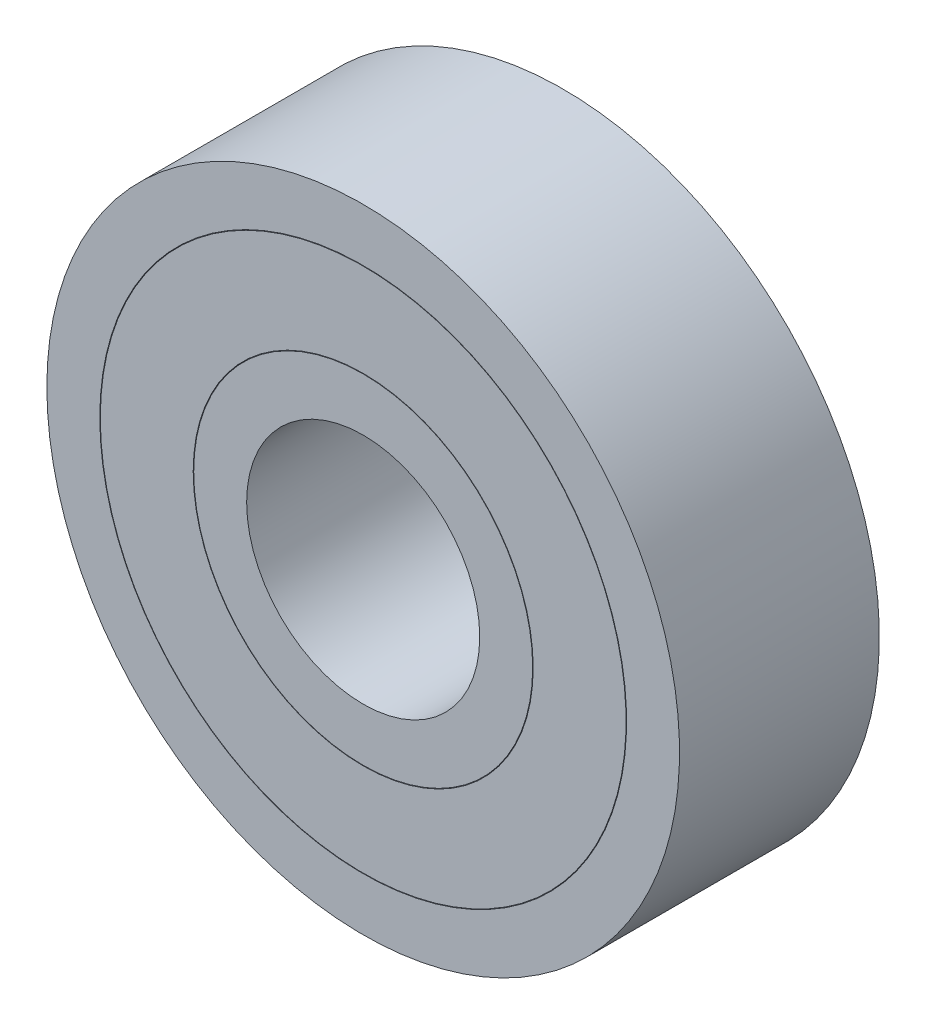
ISO-10303-21;
HEADER;
FILE_DESCRIPTION(('STEP AP214'),'2;1');
FILE_NAME('part.step','',(''),(''),'','','');
FILE_SCHEMA(('AUTOMOTIVE_DESIGN { 1 0 10303 214 1 1 1 1 }'));
ENDSEC;
DATA;
#1=APPLICATION_CONTEXT('core data for automotive mechanical design processes');
#2=APPLICATION_PROTOCOL_DEFINITION('international standard','automotive_design',2000,#1);
#3=PRODUCT_CONTEXT('',#1,'mechanical');
#4=PRODUCT('Part','Part','',(#3));
#5=PRODUCT_RELATED_PRODUCT_CATEGORY('part','',(#4));
#6=PRODUCT_DEFINITION_FORMATION('','',#4);
#7=PRODUCT_DEFINITION_CONTEXT('part definition',#1,'design');
#8=PRODUCT_DEFINITION('design','',#6,#7);
#9=PRODUCT_DEFINITION_SHAPE('','',#8);
#10=(LENGTH_UNIT() NAMED_UNIT(*) SI_UNIT(.MILLI.,.METRE.));
#11=(NAMED_UNIT(*) PLANE_ANGLE_UNIT() SI_UNIT($,.RADIAN.));
#12=(NAMED_UNIT(*) SI_UNIT($,.STERADIAN.) SOLID_ANGLE_UNIT());
#13=UNCERTAINTY_MEASURE_WITH_UNIT(LENGTH_MEASURE(1.E-05),#10,'distance_accuracy_value','');
#14=(GEOMETRIC_REPRESENTATION_CONTEXT(3) GLOBAL_UNCERTAINTY_ASSIGNED_CONTEXT((#13)) GLOBAL_UNIT_ASSIGNED_CONTEXT((#10,
#11,#12)) REPRESENTATION_CONTEXT('',''));
#15=CARTESIAN_POINT('',(0.,0.,0.));
#16=DIRECTION('',(0.,0.,1.));
#17=DIRECTION('',(1.,0.,0.));
#18=AXIS2_PLACEMENT_3D('',#15,#16,#17);
#19=CARTESIAN_POINT('',(0.,0.,3.3));
#20=DIRECTION('',(0.,0.,-1.));
#21=DIRECTION('',(-1.,0.,0.));
#22=AXIS2_PLACEMENT_3D('',#19,#20,#21);
#23=CYLINDRICAL_SURFACE('',#22,3.5);
#24=CARTESIAN_POINT('',(0.,0.,3.));
#25=DIRECTION('',(0.,0.,-1.));
#26=DIRECTION('',(-1.,0.,0.));
#27=AXIS2_PLACEMENT_3D('',#24,#25,#26);
#28=CIRCLE('',#27,3.5);
#29=CARTESIAN_POINT('',(-3.5,0.,3.));
#30=VERTEX_POINT('',#29);
#31=EDGE_CURVE('P0_E18',#30,#30,#28,.F.);
#32=ORIENTED_EDGE('',*,*,#31,.T.);
#33=EDGE_LOOP('',(#32));
#34=FACE_BOUND('',#33,.T.);
#35=CARTESIAN_POINT('',(0.,0.,-3.));
#36=DIRECTION('',(0.,0.,-1.));
#37=DIRECTION('',(-1.,0.,0.));
#38=AXIS2_PLACEMENT_3D('',#35,#36,#37);
#39=CIRCLE('',#38,3.5);
#40=CARTESIAN_POINT('',(-3.5,0.,-3.));
#41=VERTEX_POINT('',#40);
#42=EDGE_CURVE('P0_E68',#41,#41,#39,.F.);
#43=ORIENTED_EDGE('',*,*,#42,.F.);
#44=EDGE_LOOP('',(#43));
#45=FACE_BOUND('',#44,.T.);
#46=ADVANCED_FACE('P0_F15',(#34,#45),#23,.F.);
#47=CARTESIAN_POINT('',(0.,0.,3.));
#48=DIRECTION('',(0.,0.,-1.));
#49=DIRECTION('',(-1.,0.,0.));
#50=AXIS2_PLACEMENT_3D('',#47,#48,#49);
#51=PLANE('',#50);
#52=CARTESIAN_POINT('',(0.,0.,3.));
#53=DIRECTION('',(0.,0.,-1.));
#54=DIRECTION('',(-1.,0.,0.));
#55=AXIS2_PLACEMENT_3D('',#52,#53,#54);
#56=CIRCLE('',#55,5.09);
#57=CARTESIAN_POINT('',(-5.09,0.,3.));
#58=VERTEX_POINT('',#57);
#59=EDGE_CURVE('P0_E66',#58,#58,#56,.T.);
#60=ORIENTED_EDGE('',*,*,#59,.F.);
#61=EDGE_LOOP('',(#60));
#62=FACE_BOUND('',#61,.T.);
#63=ORIENTED_EDGE('',*,*,#31,.F.);
#64=EDGE_LOOP('',(#63));
#65=FACE_BOUND('',#64,.T.);
#66=ADVANCED_FACE('P0_F77',(#62,#65),#51,.F.);
#67=CARTESIAN_POINT('',(0.,0.,-3.));
#68=DIRECTION('',(0.,0.,-1.));
#69=DIRECTION('',(-1.,0.,0.));
#70=AXIS2_PLACEMENT_3D('',#67,#68,#69);
#71=PLANE('',#70);
#72=CARTESIAN_POINT('',(0.,0.,-3.));
#73=DIRECTION('',(0.,0.,-1.));
#74=DIRECTION('',(-1.,0.,0.));
#75=AXIS2_PLACEMENT_3D('',#72,#73,#74);
#76=CIRCLE('',#75,5.09);
#77=CARTESIAN_POINT('',(-5.09,0.,-3.));
#78=VERTEX_POINT('',#77);
#79=EDGE_CURVE('P0_E63',#78,#78,#76,.F.);
#80=ORIENTED_EDGE('',*,*,#79,.F.);
#81=EDGE_LOOP('',(#80));
#82=FACE_BOUND('',#81,.T.);
#83=ORIENTED_EDGE('',*,*,#42,.T.);
#84=EDGE_LOOP('',(#83));
#85=FACE_BOUND('',#84,.T.);
#86=ADVANCED_FACE('P0_F79',(#82,#85),#71,.T.);
#87=CARTESIAN_POINT('',(0.,0.,3.3));
#88=DIRECTION('',(0.,0.,-1.));
#89=DIRECTION('',(-1.,0.,0.));
#90=AXIS2_PLACEMENT_3D('',#87,#88,#89);
#91=CYLINDRICAL_SURFACE('',#90,5.09);
#92=ORIENTED_EDGE('',*,*,#59,.T.);
#93=EDGE_LOOP('',(#92));
#94=FACE_BOUND('',#93,.T.);
#95=CARTESIAN_POINT('',(0.,0.,2.25));
#96=DIRECTION('',(0.,0.,-1.));
#97=DIRECTION('',(-1.,0.,0.));
#98=AXIS2_PLACEMENT_3D('',#95,#96,#97);
#99=CIRCLE('',#98,5.09);
#100=CARTESIAN_POINT('',(-5.09,0.,2.25));
#101=VERTEX_POINT('',#100);
#102=EDGE_CURVE('P0_E60',#101,#101,#99,.F.);
#103=ORIENTED_EDGE('',*,*,#102,.T.);
#104=EDGE_LOOP('',(#103));
#105=FACE_BOUND('',#104,.T.);
#106=ADVANCED_FACE('P0_F86',(#94,#105),#91,.T.);
#107=CARTESIAN_POINT('',(0.,0.,3.3));
#108=DIRECTION('',(0.,0.,-1.));
#109=DIRECTION('',(-1.,0.,0.));
#110=AXIS2_PLACEMENT_3D('',#107,#108,#109);
#111=CYLINDRICAL_SURFACE('',#110,5.09);
#112=ORIENTED_EDGE('',*,*,#79,.T.);
#113=EDGE_LOOP('',(#112));
#114=FACE_BOUND('',#113,.T.);
#115=CARTESIAN_POINT('',(0.,0.,-2.25));
#116=DIRECTION('',(0.,0.,-1.));
#117=DIRECTION('',(-1.,0.,0.));
#118=AXIS2_PLACEMENT_3D('',#115,#116,#117);
#119=CIRCLE('',#118,5.09);
#120=CARTESIAN_POINT('',(-5.09,0.,-2.25));
#121=VERTEX_POINT('',#120);
#122=EDGE_CURVE('P0_E57',#121,#121,#119,.F.);
#123=ORIENTED_EDGE('',*,*,#122,.F.);
#124=EDGE_LOOP('',(#123));
#125=FACE_BOUND('',#124,.T.);
#126=ADVANCED_FACE('P0_F173',(#114,#125),#111,.T.);
#127=CARTESIAN_POINT('',(0.,0.,2.25));
#128=DIRECTION('',(0.,0.,-1.));
#129=DIRECTION('',(-1.,0.,0.));
#130=AXIS2_PLACEMENT_3D('',#127,#128,#129);
#131=PLANE('',#130);
#132=CARTESIAN_POINT('',(0.,0.,2.25));
#133=DIRECTION('',(0.,0.,-1.));
#134=DIRECTION('',(-1.,0.,0.));
#135=AXIS2_PLACEMENT_3D('',#132,#133,#134);
#136=CIRCLE('',#135,5.456);
#137=CARTESIAN_POINT('',(-5.456,0.,2.25));
#138=VERTEX_POINT('',#137);
#139=EDGE_CURVE('P0_E54',#138,#138,#136,.T.);
#140=ORIENTED_EDGE('',*,*,#139,.F.);
#141=EDGE_LOOP('',(#140));
#142=FACE_BOUND('',#141,.T.);
#143=ORIENTED_EDGE('',*,*,#102,.F.);
#144=EDGE_LOOP('',(#143));
#145=FACE_BOUND('',#144,.T.);
#146=ADVANCED_FACE('P0_F167',(#142,#145),#131,.F.);
#147=CARTESIAN_POINT('',(0.,0.,-2.25));
#148=DIRECTION('',(0.,0.,-1.));
#149=DIRECTION('',(-1.,0.,0.));
#150=AXIS2_PLACEMENT_3D('',#147,#148,#149);
#151=PLANE('',#150);
#152=CARTESIAN_POINT('',(0.,0.,-2.25));
#153=DIRECTION('',(0.,0.,-1.));
#154=DIRECTION('',(-1.,0.,0.));
#155=AXIS2_PLACEMENT_3D('',#152,#153,#154);
#156=CIRCLE('',#155,5.456);
#157=CARTESIAN_POINT('',(-5.456,0.,-2.25));
#158=VERTEX_POINT('',#157);
#159=EDGE_CURVE('P0_E51',#158,#158,#156,.F.);
#160=ORIENTED_EDGE('',*,*,#159,.F.);
#161=EDGE_LOOP('',(#160));
#162=FACE_BOUND('',#161,.T.);
#163=ORIENTED_EDGE('',*,*,#122,.T.);
#164=EDGE_LOOP('',(#163));
#165=FACE_BOUND('',#164,.T.);
#166=ADVANCED_FACE('P0_F159',(#162,#165),#151,.T.);
#167=CARTESIAN_POINT('',(0.,0.,3.3));
#168=DIRECTION('',(0.,0.,-1.));
#169=DIRECTION('',(-1.,0.,0.));
#170=AXIS2_PLACEMENT_3D('',#167,#168,#169);
#171=CYLINDRICAL_SURFACE('',#170,5.456);
#172=ORIENTED_EDGE('',*,*,#139,.T.);
#173=EDGE_LOOP('',(#172));
#174=FACE_BOUND('',#173,.T.);
#175=CARTESIAN_POINT('',(0.,0.,1.09094637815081));
#176=DIRECTION('',(0.,0.,-1.));
#177=DIRECTION('',(0.,-1.,0.));
#178=AXIS2_PLACEMENT_3D('',#175,#176,#177);
#179=CIRCLE('',#178,5.45600000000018);
#180=CARTESIAN_POINT('',(0.,-5.45600000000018,1.09094637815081));
#181=VERTEX_POINT('',#180);
#182=EDGE_CURVE('P0_E30',#181,#181,#179,.T.);
#183=ORIENTED_EDGE('',*,*,#182,.F.);
#184=EDGE_LOOP('',(#183));
#185=FACE_BOUND('',#184,.T.);
#186=ADVANCED_FACE('P0_F156',(#174,#185),#171,.T.);
#187=CARTESIAN_POINT('',(0.,0.,3.3));
#188=DIRECTION('',(0.,0.,-1.));
#189=DIRECTION('',(-1.,0.,0.));
#190=AXIS2_PLACEMENT_3D('',#187,#188,#189);
#191=CYLINDRICAL_SURFACE('',#190,5.456);
#192=CARTESIAN_POINT('',(0.,0.,-1.09094637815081));
#193=DIRECTION('',(0.,0.,-1.));
#194=DIRECTION('',(0.,-1.,0.));
#195=AXIS2_PLACEMENT_3D('',#192,#193,#194);
#196=CIRCLE('',#195,5.45600000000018);
#197=CARTESIAN_POINT('',(0.,-5.45600000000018,-1.09094637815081));
#198=VERTEX_POINT('',#197);
#199=EDGE_CURVE('P0_E146',#198,#198,#196,.F.);
#200=ORIENTED_EDGE('',*,*,#199,.F.);
#201=EDGE_LOOP('',(#200));
#202=FACE_BOUND('',#201,.T.);
#203=ORIENTED_EDGE('',*,*,#159,.T.);
#204=EDGE_LOOP('',(#203));
#205=FACE_BOUND('',#204,.T.);
#206=ADVANCED_FACE('P0_F158',(#202,#205),#191,.T.);
#207=CARTESIAN_POINT('',(0.,0.,0.));
#208=DIRECTION('',(0.,0.,-1.));
#209=DIRECTION('',(0.,-1.,0.));
#210=AXIS2_PLACEMENT_3D('',#207,#208,#209);
#211=TOROIDAL_SURFACE('',#210,6.5,1.51);
#212=ORIENTED_EDGE('',*,*,#182,.T.);
#213=EDGE_LOOP('',(#212));
#214=FACE_BOUND('',#213,.T.);
#215=CARTESIAN_POINT('',(0.,0.,1.090946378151));
#216=DIRECTION('',(0.,0.,-1.));
#217=DIRECTION('',(-1.,0.,0.));
#218=AXIS2_PLACEMENT_3D('',#215,#216,#217);
#219=CIRCLE('',#218,7.544);
#220=CARTESIAN_POINT('',(-7.544,0.,1.090946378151));
#221=VERTEX_POINT('',#220);
#222=EDGE_CURVE('P0_E144',#221,#221,#219,.F.);
#223=ORIENTED_EDGE('',*,*,#222,.T.);
#224=EDGE_LOOP('',(#223));
#225=FACE_BOUND('',#224,.T.);
#226=ADVANCED_FACE('P0_F137',(#214,#225),#211,.T.);
#227=CARTESIAN_POINT('',(0.,0.,0.));
#228=DIRECTION('',(0.,0.,-1.));
#229=DIRECTION('',(0.,-1.,0.));
#230=AXIS2_PLACEMENT_3D('',#227,#228,#229);
#231=TOROIDAL_SURFACE('',#230,6.5,1.51);
#232=CARTESIAN_POINT('',(0.,0.,-1.090946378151));
#233=DIRECTION('',(0.,0.,-1.));
#234=DIRECTION('',(-1.,0.,0.));
#235=AXIS2_PLACEMENT_3D('',#232,#233,#234);
#236=CIRCLE('',#235,7.544);
#237=CARTESIAN_POINT('',(-7.544,0.,-1.090946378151));
#238=VERTEX_POINT('',#237);
#239=EDGE_CURVE('P0_E50',#238,#238,#236,.T.);
#240=ORIENTED_EDGE('',*,*,#239,.T.);
#241=EDGE_LOOP('',(#240));
#242=FACE_BOUND('',#241,.T.);
#243=ORIENTED_EDGE('',*,*,#199,.T.);
#244=EDGE_LOOP('',(#243));
#245=FACE_BOUND('',#244,.T.);
#246=ADVANCED_FACE('P0_F132',(#242,#245),#231,.T.);
#247=CARTESIAN_POINT('',(0.,0.,3.3));
#248=DIRECTION('',(0.,0.,-1.));
#249=DIRECTION('',(-1.,0.,0.));
#250=AXIS2_PLACEMENT_3D('',#247,#248,#249);
#251=CYLINDRICAL_SURFACE('',#250,7.544);
#252=ORIENTED_EDGE('',*,*,#222,.F.);
#253=EDGE_LOOP('',(#252));
#254=FACE_BOUND('',#253,.T.);
#255=CARTESIAN_POINT('',(0.,0.,2.25));
#256=DIRECTION('',(0.,0.,-1.));
#257=DIRECTION('',(-1.,0.,0.));
#258=AXIS2_PLACEMENT_3D('',#255,#256,#257);
#259=CIRCLE('',#258,7.544);
#260=CARTESIAN_POINT('',(-7.544,0.,2.25));
#261=VERTEX_POINT('',#260);
#262=EDGE_CURVE('P0_E47',#261,#261,#259,.F.);
#263=ORIENTED_EDGE('',*,*,#262,.T.);
#264=EDGE_LOOP('',(#263));
#265=FACE_BOUND('',#264,.T.);
#266=ADVANCED_FACE('P0_F128',(#254,#265),#251,.F.);
#267=CARTESIAN_POINT('',(0.,0.,3.3));
#268=DIRECTION('',(0.,0.,-1.));
#269=DIRECTION('',(-1.,0.,0.));
#270=AXIS2_PLACEMENT_3D('',#267,#268,#269);
#271=CYLINDRICAL_SURFACE('',#270,7.544);
#272=ORIENTED_EDGE('',*,*,#239,.F.);
#273=EDGE_LOOP('',(#272));
#274=FACE_BOUND('',#273,.T.);
#275=CARTESIAN_POINT('',(0.,0.,-2.25));
#276=DIRECTION('',(0.,0.,-1.));
#277=DIRECTION('',(-1.,0.,0.));
#278=AXIS2_PLACEMENT_3D('',#275,#276,#277);
#279=CIRCLE('',#278,7.544);
#280=CARTESIAN_POINT('',(-7.544,0.,-2.25));
#281=VERTEX_POINT('',#280);
#282=EDGE_CURVE('P0_E44',#281,#281,#279,.F.);
#283=ORIENTED_EDGE('',*,*,#282,.F.);
#284=EDGE_LOOP('',(#283));
#285=FACE_BOUND('',#284,.T.);
#286=ADVANCED_FACE('P0_F124',(#274,#285),#271,.F.);
#287=CARTESIAN_POINT('',(0.,0.,2.25));
#288=DIRECTION('',(0.,0.,-1.));
#289=DIRECTION('',(-1.,0.,0.));
#290=AXIS2_PLACEMENT_3D('',#287,#288,#289);
#291=PLANE('',#290);
#292=CARTESIAN_POINT('',(0.,0.,2.25));
#293=DIRECTION('',(0.,0.,-1.));
#294=DIRECTION('',(-1.,0.,0.));
#295=AXIS2_PLACEMENT_3D('',#292,#293,#294);
#296=CIRCLE('',#295,7.91);
#297=CARTESIAN_POINT('',(-7.91,0.,2.25));
#298=VERTEX_POINT('',#297);
#299=EDGE_CURVE('P0_E41',#298,#298,#296,.F.);
#300=ORIENTED_EDGE('',*,*,#299,.T.);
#301=EDGE_LOOP('',(#300));
#302=FACE_BOUND('',#301,.T.);
#303=ORIENTED_EDGE('',*,*,#262,.F.);
#304=EDGE_LOOP('',(#303));
#305=FACE_BOUND('',#304,.T.);
#306=ADVANCED_FACE('P0_F120',(#302,#305),#291,.F.);
#307=CARTESIAN_POINT('',(0.,0.,-2.25));
#308=DIRECTION('',(0.,0.,-1.));
#309=DIRECTION('',(-1.,0.,0.));
#310=AXIS2_PLACEMENT_3D('',#307,#308,#309);
#311=PLANE('',#310);
#312=CARTESIAN_POINT('',(0.,0.,-2.25));
#313=DIRECTION('',(0.,0.,-1.));
#314=DIRECTION('',(-1.,0.,0.));
#315=AXIS2_PLACEMENT_3D('',#312,#313,#314);
#316=CIRCLE('',#315,7.91);
#317=CARTESIAN_POINT('',(-7.91,0.,-2.25));
#318=VERTEX_POINT('',#317);
#319=EDGE_CURVE('P0_E38',#318,#318,#316,.T.);
#320=ORIENTED_EDGE('',*,*,#319,.T.);
#321=EDGE_LOOP('',(#320));
#322=FACE_BOUND('',#321,.T.);
#323=ORIENTED_EDGE('',*,*,#282,.T.);
#324=EDGE_LOOP('',(#323));
#325=FACE_BOUND('',#324,.T.);
#326=ADVANCED_FACE('P0_F116',(#322,#325),#311,.T.);
#327=CARTESIAN_POINT('',(0.,0.,3.3));
#328=DIRECTION('',(0.,0.,-1.));
#329=DIRECTION('',(-1.,0.,0.));
#330=AXIS2_PLACEMENT_3D('',#327,#328,#329);
#331=CYLINDRICAL_SURFACE('',#330,7.91);
#332=ORIENTED_EDGE('',*,*,#299,.F.);
#333=EDGE_LOOP('',(#332));
#334=FACE_BOUND('',#333,.T.);
#335=CARTESIAN_POINT('',(0.,0.,3.));
#336=DIRECTION('',(0.,0.,-1.));
#337=DIRECTION('',(-1.,0.,0.));
#338=AXIS2_PLACEMENT_3D('',#335,#336,#337);
#339=CIRCLE('',#338,7.91);
#340=CARTESIAN_POINT('',(-7.91,0.,3.));
#341=VERTEX_POINT('',#340);
#342=EDGE_CURVE('P0_E35',#341,#341,#339,.F.);
#343=ORIENTED_EDGE('',*,*,#342,.T.);
#344=EDGE_LOOP('',(#343));
#345=FACE_BOUND('',#344,.T.);
#346=ADVANCED_FACE('P0_F112',(#334,#345),#331,.F.);
#347=CARTESIAN_POINT('',(0.,0.,3.3));
#348=DIRECTION('',(0.,0.,-1.));
#349=DIRECTION('',(-1.,0.,0.));
#350=AXIS2_PLACEMENT_3D('',#347,#348,#349);
#351=CYLINDRICAL_SURFACE('',#350,7.91);
#352=ORIENTED_EDGE('',*,*,#319,.F.);
#353=EDGE_LOOP('',(#352));
#354=FACE_BOUND('',#353,.T.);
#355=CARTESIAN_POINT('',(0.,0.,-3.));
#356=DIRECTION('',(0.,0.,-1.));
#357=DIRECTION('',(-1.,0.,0.));
#358=AXIS2_PLACEMENT_3D('',#355,#356,#357);
#359=CIRCLE('',#358,7.91);
#360=CARTESIAN_POINT('',(-7.91,0.,-3.));
#361=VERTEX_POINT('',#360);
#362=EDGE_CURVE('P0_E27',#361,#361,#359,.F.);
#363=ORIENTED_EDGE('',*,*,#362,.F.);
#364=EDGE_LOOP('',(#363));
#365=FACE_BOUND('',#364,.T.);
#366=ADVANCED_FACE('P0_F108',(#354,#365),#351,.F.);
#367=CARTESIAN_POINT('',(0.,0.,3.));
#368=DIRECTION('',(0.,0.,-1.));
#369=DIRECTION('',(-1.,0.,0.));
#370=AXIS2_PLACEMENT_3D('',#367,#368,#369);
#371=PLANE('',#370);
#372=CARTESIAN_POINT('',(0.,0.,3.));
#373=DIRECTION('',(0.,0.,-1.));
#374=DIRECTION('',(-1.,0.,0.));
#375=AXIS2_PLACEMENT_3D('',#372,#373,#374);
#376=CIRCLE('',#375,9.5);
#377=CARTESIAN_POINT('',(-9.5,0.,3.));
#378=VERTEX_POINT('',#377);
#379=EDGE_CURVE('P0_E22',#378,#378,#376,.T.);
#380=ORIENTED_EDGE('',*,*,#379,.F.);
#381=EDGE_LOOP('',(#380));
#382=FACE_BOUND('',#381,.T.);
#383=ORIENTED_EDGE('',*,*,#342,.F.);
#384=EDGE_LOOP('',(#383));
#385=FACE_BOUND('',#384,.T.);
#386=ADVANCED_FACE('P0_F98',(#382,#385),#371,.F.);
#387=CARTESIAN_POINT('',(0.,0.,-3.));
#388=DIRECTION('',(0.,0.,-1.));
#389=DIRECTION('',(-1.,0.,0.));
#390=AXIS2_PLACEMENT_3D('',#387,#388,#389);
#391=PLANE('',#390);
#392=CARTESIAN_POINT('',(0.,0.,-3.));
#393=DIRECTION('',(0.,0.,-1.));
#394=DIRECTION('',(-1.,0.,0.));
#395=AXIS2_PLACEMENT_3D('',#392,#393,#394);
#396=CIRCLE('',#395,9.5);
#397=CARTESIAN_POINT('',(-9.5,0.,-3.));
#398=VERTEX_POINT('',#397);
#399=EDGE_CURVE('P0_E10',#398,#398,#396,.F.);
#400=ORIENTED_EDGE('',*,*,#399,.F.);
#401=EDGE_LOOP('',(#400));
#402=FACE_BOUND('',#401,.T.);
#403=ORIENTED_EDGE('',*,*,#362,.T.);
#404=EDGE_LOOP('',(#403));
#405=FACE_BOUND('',#404,.T.);
#406=ADVANCED_FACE('P0_F92',(#402,#405),#391,.T.);
#407=CARTESIAN_POINT('',(0.,0.,3.3));
#408=DIRECTION('',(0.,0.,-1.));
#409=DIRECTION('',(-1.,0.,0.));
#410=AXIS2_PLACEMENT_3D('',#407,#408,#409);
#411=CYLINDRICAL_SURFACE('',#410,9.5);
#412=ORIENTED_EDGE('',*,*,#399,.T.);
#413=EDGE_LOOP('',(#412));
#414=FACE_BOUND('',#413,.T.);
#415=ORIENTED_EDGE('',*,*,#379,.T.);
#416=EDGE_LOOP('',(#415));
#417=FACE_BOUND('',#416,.T.);
#418=ADVANCED_FACE('P0_F90',(#414,#417),#411,.T.);
#419=CLOSED_SHELL('',(#46,#66,#86,#106,#126,#146,#166,#186,#206,#226,#246,#266,#286,#306,#326,
#346,#366,#386,#406,#418));
#420=CARTESIAN_POINT('',(0.,0.,0.));
#421=DIRECTION('',(0.,0.,-1.));
#422=DIRECTION('',(0.,-1.,0.));
#423=AXIS2_PLACEMENT_3D('',#420,#421,#422);
#424=TOROIDAL_SURFACE('',#423,6.5,1.5);
#425=ADVANCED_FACE('P0_F103',(),#424,.F.);
#426=CLOSED_SHELL('',(#425));
#427=ORIENTED_CLOSED_SHELL('',*,#426,.T.);
#428=BREP_WITH_VOIDS('P0_B1',#419,(#427));
#429=CARTESIAN_POINT('',(0.,0.,2.625));
#430=DIRECTION('',(0.,0.,-1.));
#431=DIRECTION('',(-1.,0.,0.));
#432=AXIS2_PLACEMENT_3D('',#429,#430,#431);
#433=PLANE('',#432);
#434=CARTESIAN_POINT('',(0.,0.,2.625));
#435=DIRECTION('',(0.,0.,-1.));
#436=DIRECTION('',(-1.,0.,0.));
#437=AXIS2_PLACEMENT_3D('',#434,#435,#436);
#438=CIRCLE('',#437,7.895);
#439=CARTESIAN_POINT('',(-7.895,0.,2.625));
#440=VERTEX_POINT('',#439);
#441=EDGE_CURVE('P1_E26',#440,#440,#438,.F.);
#442=ORIENTED_EDGE('',*,*,#441,.F.);
#443=EDGE_LOOP('',(#442));
#444=FACE_BOUND('',#443,.T.);
#445=CARTESIAN_POINT('',(0.,0.,2.625));
#446=DIRECTION('',(0.,0.,-1.));
#447=DIRECTION('',(-1.,0.,0.));
#448=AXIS2_PLACEMENT_3D('',#445,#446,#447);
#449=CIRCLE('',#448,5.105);
#450=CARTESIAN_POINT('',(-5.105,0.,2.625));
#451=VERTEX_POINT('',#450);
#452=EDGE_CURVE('P1_E17',#451,#451,#449,.F.);
#453=ORIENTED_EDGE('',*,*,#452,.T.);
#454=EDGE_LOOP('',(#453));
#455=FACE_BOUND('',#454,.T.);
#456=ADVANCED_FACE('P1_F14',(#444,#455),#433,.T.);
#457=CARTESIAN_POINT('',(0.,0.,3.3));
#458=DIRECTION('',(0.,0.,-1.));
#459=DIRECTION('',(-1.,0.,0.));
#460=AXIS2_PLACEMENT_3D('',#457,#458,#459);
#461=CYLINDRICAL_SURFACE('',#460,5.105);
#462=ORIENTED_EDGE('',*,*,#452,.F.);
#463=EDGE_LOOP('',(#462));
#464=FACE_BOUND('',#463,.T.);
#465=CARTESIAN_POINT('',(0.,0.,3.));
#466=DIRECTION('',(0.,0.,-1.));
#467=DIRECTION('',(-1.,0.,0.));
#468=AXIS2_PLACEMENT_3D('',#465,#466,#467);
#469=CIRCLE('',#468,5.105);
#470=CARTESIAN_POINT('',(-5.105,0.,3.));
#471=VERTEX_POINT('',#470);
#472=EDGE_CURVE('P1_E21',#471,#471,#469,.F.);
#473=ORIENTED_EDGE('',*,*,#472,.T.);
#474=EDGE_LOOP('',(#473));
#475=FACE_BOUND('',#474,.T.);
#476=ADVANCED_FACE('P1_F35',(#464,#475),#461,.F.);
#477=CARTESIAN_POINT('',(0.,0.,3.3));
#478=DIRECTION('',(0.,0.,-1.));
#479=DIRECTION('',(-1.,0.,0.));
#480=AXIS2_PLACEMENT_3D('',#477,#478,#479);
#481=CYLINDRICAL_SURFACE('',#480,7.895);
#482=ORIENTED_EDGE('',*,*,#441,.T.);
#483=EDGE_LOOP('',(#482));
#484=FACE_BOUND('',#483,.T.);
#485=CARTESIAN_POINT('',(0.,0.,3.));
#486=DIRECTION('',(0.,0.,-1.));
#487=DIRECTION('',(-1.,0.,0.));
#488=AXIS2_PLACEMENT_3D('',#485,#486,#487);
#489=CIRCLE('',#488,7.895);
#490=CARTESIAN_POINT('',(-7.895,0.,3.));
#491=VERTEX_POINT('',#490);
#492=EDGE_CURVE('P1_E10',#491,#491,#489,.T.);
#493=ORIENTED_EDGE('',*,*,#492,.T.);
#494=EDGE_LOOP('',(#493));
#495=FACE_BOUND('',#494,.T.);
#496=ADVANCED_FACE('P1_F38',(#484,#495),#481,.T.);
#497=CARTESIAN_POINT('',(0.,0.,3.));
#498=DIRECTION('',(0.,0.,-1.));
#499=DIRECTION('',(-1.,0.,0.));
#500=AXIS2_PLACEMENT_3D('',#497,#498,#499);
#501=PLANE('',#500);
#502=ORIENTED_EDGE('',*,*,#492,.F.);
#503=EDGE_LOOP('',(#502));
#504=FACE_BOUND('',#503,.T.);
#505=ORIENTED_EDGE('',*,*,#472,.F.);
#506=EDGE_LOOP('',(#505));
#507=FACE_BOUND('',#506,.T.);
#508=ADVANCED_FACE('P1_F41',(#504,#507),#501,.F.);
#509=CLOSED_SHELL('',(#456,#476,#496,#508));
#510=MANIFOLD_SOLID_BREP('P1_B1',#509);
#511=ADVANCED_BREP_SHAPE_REPRESENTATION('',(#18,#428,#510),#14);
#512=SHAPE_DEFINITION_REPRESENTATION(#9,#511);
ENDSEC;
END-ISO-10303-21;
